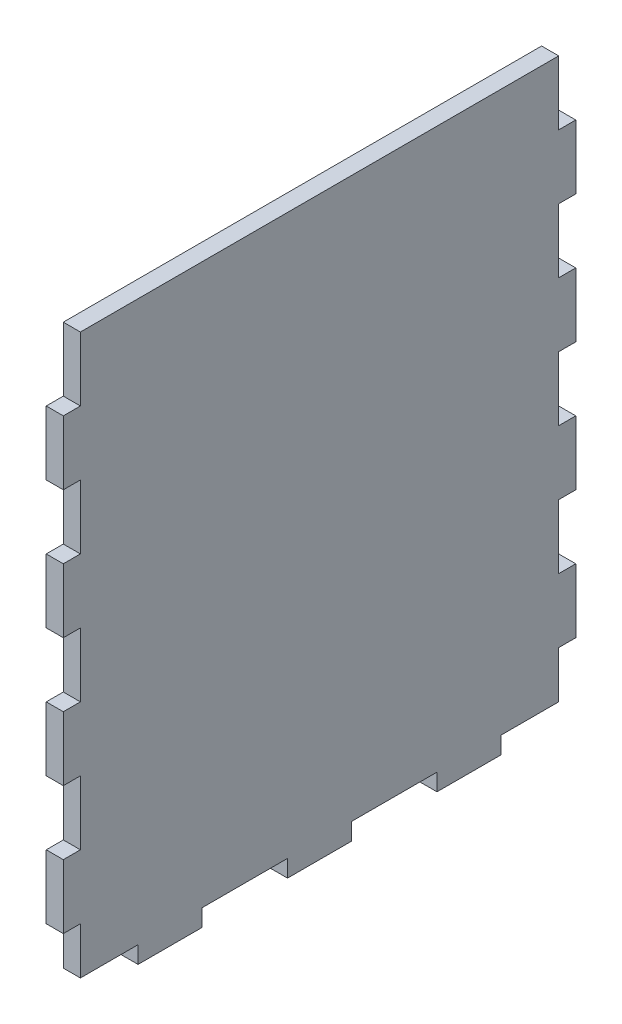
ISO-10303-21;
HEADER;
FILE_DESCRIPTION(('STEP AP214'),'2;1');
FILE_NAME('part.step','',(''),(''),'','','');
FILE_SCHEMA(('AUTOMOTIVE_DESIGN { 1 0 10303 214 1 1 1 1 }'));
ENDSEC;
DATA;
#1=APPLICATION_CONTEXT('core data for automotive mechanical design processes');
#2=APPLICATION_PROTOCOL_DEFINITION('international standard','automotive_design',2000,#1);
#3=PRODUCT_CONTEXT('',#1,'mechanical');
#4=PRODUCT('Part','Part','',(#3));
#5=PRODUCT_RELATED_PRODUCT_CATEGORY('part','',(#4));
#6=PRODUCT_DEFINITION_FORMATION('','',#4);
#7=PRODUCT_DEFINITION_CONTEXT('part definition',#1,'design');
#8=PRODUCT_DEFINITION('design','',#6,#7);
#9=PRODUCT_DEFINITION_SHAPE('','',#8);
#10=(LENGTH_UNIT() NAMED_UNIT(*) SI_UNIT(.MILLI.,.METRE.));
#11=(NAMED_UNIT(*) PLANE_ANGLE_UNIT() SI_UNIT($,.RADIAN.));
#12=(NAMED_UNIT(*) SI_UNIT($,.STERADIAN.) SOLID_ANGLE_UNIT());
#13=UNCERTAINTY_MEASURE_WITH_UNIT(LENGTH_MEASURE(1.E-05),#10,'distance_accuracy_value','');
#14=(GEOMETRIC_REPRESENTATION_CONTEXT(3) GLOBAL_UNCERTAINTY_ASSIGNED_CONTEXT((#13)) GLOBAL_UNIT_ASSIGNED_CONTEXT((#10,
#11,#12)) REPRESENTATION_CONTEXT('',''));
#15=CARTESIAN_POINT('',(0.,0.,0.));
#16=DIRECTION('',(0.,0.,1.));
#17=DIRECTION('',(1.,0.,0.));
#18=AXIS2_PLACEMENT_3D('',#15,#16,#17);
#19=CARTESIAN_POINT('',(4.,0.,-120.));
#20=DIRECTION('',(0.,0.,1.));
#21=DIRECTION('',(1.,0.,0.));
#22=AXIS2_PLACEMENT_3D('',#19,#20,#21);
#23=PLANE('',#22);
#24=DIRECTION('',(1.,0.,0.));
#25=VECTOR('',#24,1.);
#26=CARTESIAN_POINT('',(0.,15.,-120.));
#27=LINE('',#26,#25);
#28=CARTESIAN_POINT('',(0.,15.,-120.));
#29=VERTEX_POINT('',#28);
#30=CARTESIAN_POINT('',(4.,15.,-120.));
#31=VERTEX_POINT('',#30);
#32=EDGE_CURVE('E357',#29,#31,#27,.T.);
#33=ORIENTED_EDGE('',*,*,#32,.F.);
#34=DIRECTION('',(0.,1.,0.));
#35=VECTOR('',#34,1.);
#36=CARTESIAN_POINT('',(0.,0.,-120.));
#37=LINE('',#36,#35);
#38=CARTESIAN_POINT('',(0.,30.,-120.));
#39=VERTEX_POINT('',#38);
#40=EDGE_CURVE('E372',#29,#39,#37,.T.);
#41=ORIENTED_EDGE('',*,*,#40,.T.);
#42=DIRECTION('',(1.,0.,0.));
#43=VECTOR('',#42,1.);
#44=CARTESIAN_POINT('',(0.,30.,-120.));
#45=LINE('',#44,#43);
#46=CARTESIAN_POINT('',(4.,30.,-120.));
#47=VERTEX_POINT('',#46);
#48=EDGE_CURVE('E834',#39,#47,#45,.T.);
#49=ORIENTED_EDGE('',*,*,#48,.T.);
#50=DIRECTION('',(0.,1.,0.));
#51=VECTOR('',#50,1.);
#52=CARTESIAN_POINT('',(4.,0.,-120.));
#53=LINE('',#52,#51);
#54=EDGE_CURVE('E374',#31,#47,#53,.T.);
#55=ORIENTED_EDGE('',*,*,#54,.F.);
#56=EDGE_LOOP('',(#33,#41,#49,#55));
#57=FACE_BOUND('',#56,.T.);
#58=ADVANCED_FACE('F48',(#57),#23,.F.);
#59=DIRECTION('',(1.,0.,0.));
#60=VECTOR('',#59,1.);
#61=CARTESIAN_POINT('',(0.,120.,-120.));
#62=LINE('',#61,#60);
#63=CARTESIAN_POINT('',(0.,120.,-120.));
#64=VERTEX_POINT('',#63);
#65=CARTESIAN_POINT('',(4.,120.,-120.));
#66=VERTEX_POINT('',#65);
#67=EDGE_CURVE('E821',#64,#66,#62,.T.);
#68=ORIENTED_EDGE('',*,*,#67,.T.);
#69=CARTESIAN_POINT('',(4.,105.,-120.));
#70=VERTEX_POINT('',#69);
#71=EDGE_CURVE('E464',#70,#66,#53,.T.);
#72=ORIENTED_EDGE('',*,*,#71,.F.);
#73=DIRECTION('',(1.,0.,0.));
#74=VECTOR('',#73,1.);
#75=CARTESIAN_POINT('',(0.,105.,-120.));
#76=LINE('',#75,#74);
#77=CARTESIAN_POINT('',(0.,105.,-120.));
#78=VERTEX_POINT('',#77);
#79=EDGE_CURVE('E841',#78,#70,#76,.T.);
#80=ORIENTED_EDGE('',*,*,#79,.F.);
#81=EDGE_CURVE('E385',#78,#64,#37,.T.);
#82=ORIENTED_EDGE('',*,*,#81,.T.);
#83=EDGE_LOOP('',(#68,#72,#80,#82));
#84=FACE_BOUND('',#83,.T.);
#85=ADVANCED_FACE('F991',(#84),#23,.F.);
#86=DIRECTION('',(1.,0.,0.));
#87=VECTOR('',#86,1.);
#88=CARTESIAN_POINT('',(0.,60.,-120.));
#89=LINE('',#88,#87);
#90=CARTESIAN_POINT('',(0.,60.,-120.));
#91=VERTEX_POINT('',#90);
#92=CARTESIAN_POINT('',(4.,60.,-120.));
#93=VERTEX_POINT('',#92);
#94=EDGE_CURVE('E859',#91,#93,#89,.T.);
#95=ORIENTED_EDGE('',*,*,#94,.T.);
#96=CARTESIAN_POINT('',(4.,45.,-120.));
#97=VERTEX_POINT('',#96);
#98=EDGE_CURVE('E883',#97,#93,#53,.T.);
#99=ORIENTED_EDGE('',*,*,#98,.F.);
#100=DIRECTION('',(1.,0.,0.));
#101=VECTOR('',#100,1.);
#102=CARTESIAN_POINT('',(0.,45.,-120.));
#103=LINE('',#102,#101);
#104=CARTESIAN_POINT('',(0.,45.,-120.));
#105=VERTEX_POINT('',#104);
#106=EDGE_CURVE('E523',#105,#97,#103,.T.);
#107=ORIENTED_EDGE('',*,*,#106,.F.);
#108=EDGE_CURVE('E383',#105,#91,#37,.T.);
#109=ORIENTED_EDGE('',*,*,#108,.T.);
#110=EDGE_LOOP('',(#95,#99,#107,#109));
#111=FACE_BOUND('',#110,.T.);
#112=ADVANCED_FACE('F890',(#111),#23,.F.);
#113=DIRECTION('',(1.,0.,0.));
#114=VECTOR('',#113,1.);
#115=CARTESIAN_POINT('',(0.,75.,-120.));
#116=LINE('',#115,#114);
#117=CARTESIAN_POINT('',(0.,75.,-120.));
#118=VERTEX_POINT('',#117);
#119=CARTESIAN_POINT('',(4.,75.,-120.));
#120=VERTEX_POINT('',#119);
#121=EDGE_CURVE('E1006',#118,#120,#116,.T.);
#122=ORIENTED_EDGE('',*,*,#121,.F.);
#123=CARTESIAN_POINT('',(0.,90.,-120.));
#124=VERTEX_POINT('',#123);
#125=EDGE_CURVE('E392',#118,#124,#37,.T.);
#126=ORIENTED_EDGE('',*,*,#125,.T.);
#127=DIRECTION('',(1.,0.,0.));
#128=VECTOR('',#127,1.);
#129=CARTESIAN_POINT('',(0.,90.,-120.));
#130=LINE('',#129,#128);
#131=CARTESIAN_POINT('',(4.,90.,-120.));
#132=VERTEX_POINT('',#131);
#133=EDGE_CURVE('E366',#124,#132,#130,.T.);
#134=ORIENTED_EDGE('',*,*,#133,.T.);
#135=EDGE_CURVE('E892',#120,#132,#53,.T.);
#136=ORIENTED_EDGE('',*,*,#135,.F.);
#137=EDGE_LOOP('',(#122,#126,#134,#136));
#138=FACE_BOUND('',#137,.T.);
#139=ADVANCED_FACE('F992',(#138),#23,.F.);
#140=CARTESIAN_POINT('',(4.,0.,0.));
#141=DIRECTION('',(1.,0.,0.));
#142=DIRECTION('',(0.,0.,-1.));
#143=AXIS2_PLACEMENT_3D('',#140,#141,#142);
#144=PLANE('',#143);
#145=DIRECTION('',(0.,0.,-1.));
#146=VECTOR('',#145,1.);
#147=CARTESIAN_POINT('',(4.,4.,0.));
#148=LINE('',#147,#146);
#149=CARTESIAN_POINT('',(4.,4.,-102.5));
#150=VERTEX_POINT('',#149);
#151=CARTESIAN_POINT('',(4.,4.,-116.));
#152=VERTEX_POINT('',#151);
#153=EDGE_CURVE('E503',#150,#152,#148,.T.);
#154=ORIENTED_EDGE('',*,*,#153,.T.);
#155=DIRECTION('',(0.,1.,0.));
#156=VECTOR('',#155,1.);
#157=CARTESIAN_POINT('',(4.,0.,-116.));
#158=LINE('',#157,#156);
#159=CARTESIAN_POINT('',(4.,15.,-116.));
#160=VERTEX_POINT('',#159);
#161=EDGE_CURVE('E516',#152,#160,#158,.T.);
#162=ORIENTED_EDGE('',*,*,#161,.T.);
#163=DIRECTION('',(0.,0.,-1.));
#164=VECTOR('',#163,1.);
#165=CARTESIAN_POINT('',(4.,15.,0.));
#166=LINE('',#165,#164);
#167=EDGE_CURVE('E783',#160,#31,#166,.T.);
#168=ORIENTED_EDGE('',*,*,#167,.T.);
#169=ORIENTED_EDGE('',*,*,#54,.T.);
#170=DIRECTION('',(0.,0.,1.));
#171=VECTOR('',#170,1.);
#172=CARTESIAN_POINT('',(4.,30.,0.));
#173=LINE('',#172,#171);
#174=CARTESIAN_POINT('',(4.,30.,-116.));
#175=VERTEX_POINT('',#174);
#176=EDGE_CURVE('E1043',#47,#175,#173,.T.);
#177=ORIENTED_EDGE('',*,*,#176,.T.);
#178=DIRECTION('',(0.,1.,0.));
#179=VECTOR('',#178,1.);
#180=CARTESIAN_POINT('',(4.,0.,-116.));
#181=LINE('',#180,#179);
#182=CARTESIAN_POINT('',(4.,45.,-116.));
#183=VERTEX_POINT('',#182);
#184=EDGE_CURVE('E885',#175,#183,#181,.T.);
#185=ORIENTED_EDGE('',*,*,#184,.T.);
#186=DIRECTION('',(0.,0.,-1.));
#187=VECTOR('',#186,1.);
#188=CARTESIAN_POINT('',(4.,45.,0.));
#189=LINE('',#188,#187);
#190=EDGE_CURVE('E876',#183,#97,#189,.T.);
#191=ORIENTED_EDGE('',*,*,#190,.T.);
#192=ORIENTED_EDGE('',*,*,#98,.T.);
#193=DIRECTION('',(0.,0.,1.));
#194=VECTOR('',#193,1.);
#195=CARTESIAN_POINT('',(4.,60.,0.));
#196=LINE('',#195,#194);
#197=CARTESIAN_POINT('',(4.,60.,-116.));
#198=VERTEX_POINT('',#197);
#199=EDGE_CURVE('E1050',#93,#198,#196,.T.);
#200=ORIENTED_EDGE('',*,*,#199,.T.);
#201=DIRECTION('',(0.,1.,0.));
#202=VECTOR('',#201,1.);
#203=CARTESIAN_POINT('',(4.,0.,-116.));
#204=LINE('',#203,#202);
#205=CARTESIAN_POINT('',(4.,75.,-116.));
#206=VERTEX_POINT('',#205);
#207=EDGE_CURVE('E1042',#198,#206,#204,.T.);
#208=ORIENTED_EDGE('',*,*,#207,.T.);
#209=DIRECTION('',(0.,0.,-1.));
#210=VECTOR('',#209,1.);
#211=CARTESIAN_POINT('',(4.,75.,0.));
#212=LINE('',#211,#210);
#213=EDGE_CURVE('E1038',#206,#120,#212,.T.);
#214=ORIENTED_EDGE('',*,*,#213,.T.);
#215=ORIENTED_EDGE('',*,*,#135,.T.);
#216=DIRECTION('',(0.,0.,1.));
#217=VECTOR('',#216,1.);
#218=CARTESIAN_POINT('',(4.,90.,0.));
#219=LINE('',#218,#217);
#220=CARTESIAN_POINT('',(4.,90.,-116.));
#221=VERTEX_POINT('',#220);
#222=EDGE_CURVE('E887',#132,#221,#219,.T.);
#223=ORIENTED_EDGE('',*,*,#222,.T.);
#224=DIRECTION('',(0.,1.,0.));
#225=VECTOR('',#224,1.);
#226=CARTESIAN_POINT('',(4.,0.,-116.));
#227=LINE('',#226,#225);
#228=CARTESIAN_POINT('',(4.,105.,-116.));
#229=VERTEX_POINT('',#228);
#230=EDGE_CURVE('E1022',#221,#229,#227,.T.);
#231=ORIENTED_EDGE('',*,*,#230,.T.);
#232=DIRECTION('',(0.,0.,-1.));
#233=VECTOR('',#232,1.);
#234=CARTESIAN_POINT('',(4.,105.,-3.64291929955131E-13));
#235=LINE('',#234,#233);
#236=EDGE_CURVE('E529',#229,#70,#235,.T.);
#237=ORIENTED_EDGE('',*,*,#236,.T.);
#238=ORIENTED_EDGE('',*,*,#71,.T.);
#239=DIRECTION('',(0.,0.,1.));
#240=VECTOR('',#239,1.);
#241=CARTESIAN_POINT('',(4.,120.,0.));
#242=LINE('',#241,#240);
#243=CARTESIAN_POINT('',(4.,120.,-116.));
#244=VERTEX_POINT('',#243);
#245=EDGE_CURVE('E808',#66,#244,#242,.T.);
#246=ORIENTED_EDGE('',*,*,#245,.T.);
#247=DIRECTION('',(0.,1.,0.));
#248=VECTOR('',#247,1.);
#249=CARTESIAN_POINT('',(4.,0.,-116.));
#250=LINE('',#249,#248);
#251=CARTESIAN_POINT('',(4.,135.,-116.));
#252=VERTEX_POINT('',#251);
#253=EDGE_CURVE('E522',#244,#252,#250,.T.);
#254=ORIENTED_EDGE('',*,*,#253,.T.);
#255=DIRECTION('',(0.,0.,-1.));
#256=VECTOR('',#255,1.);
#257=CARTESIAN_POINT('',(4.,135.,0.));
#258=LINE('',#257,#256);
#259=CARTESIAN_POINT('',(4.,135.,-4.));
#260=VERTEX_POINT('',#259);
#261=EDGE_CURVE('E540',#260,#252,#258,.T.);
#262=ORIENTED_EDGE('',*,*,#261,.F.);
#263=DIRECTION('',(0.,1.,0.));
#264=VECTOR('',#263,1.);
#265=CARTESIAN_POINT('',(4.,0.,-4.));
#266=LINE('',#265,#264);
#267=CARTESIAN_POINT('',(4.,120.,-4.));
#268=VERTEX_POINT('',#267);
#269=EDGE_CURVE('E602',#268,#260,#266,.T.);
#270=ORIENTED_EDGE('',*,*,#269,.F.);
#271=DIRECTION('',(0.,0.,-1.));
#272=VECTOR('',#271,1.);
#273=CARTESIAN_POINT('',(4.,120.,0.));
#274=LINE('',#273,#272);
#275=CARTESIAN_POINT('',(4.,120.,0.));
#276=VERTEX_POINT('',#275);
#277=EDGE_CURVE('E586',#276,#268,#274,.T.);
#278=ORIENTED_EDGE('',*,*,#277,.F.);
#279=DIRECTION('',(0.,1.,0.));
#280=VECTOR('',#279,1.);
#281=CARTESIAN_POINT('',(4.,0.,0.));
#282=LINE('',#281,#280);
#283=CARTESIAN_POINT('',(4.,105.,0.));
#284=VERTEX_POINT('',#283);
#285=EDGE_CURVE('E544',#284,#276,#282,.T.);
#286=ORIENTED_EDGE('',*,*,#285,.F.);
#287=DIRECTION('',(0.,0.,1.));
#288=VECTOR('',#287,1.);
#289=CARTESIAN_POINT('',(4.,105.,3.6429192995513E-13));
#290=LINE('',#289,#288);
#291=CARTESIAN_POINT('',(4.,105.,-4.));
#292=VERTEX_POINT('',#291);
#293=EDGE_CURVE('E617',#292,#284,#290,.T.);
#294=ORIENTED_EDGE('',*,*,#293,.F.);
#295=DIRECTION('',(0.,1.,0.));
#296=VECTOR('',#295,1.);
#297=CARTESIAN_POINT('',(4.,0.,-4.));
#298=LINE('',#297,#296);
#299=CARTESIAN_POINT('',(4.,90.,-4.));
#300=VERTEX_POINT('',#299);
#301=EDGE_CURVE('E613',#300,#292,#298,.T.);
#302=ORIENTED_EDGE('',*,*,#301,.F.);
#303=DIRECTION('',(0.,0.,-1.));
#304=VECTOR('',#303,1.);
#305=CARTESIAN_POINT('',(4.,90.,0.));
#306=LINE('',#305,#304);
#307=CARTESIAN_POINT('',(4.,90.,0.));
#308=VERTEX_POINT('',#307);
#309=EDGE_CURVE('E609',#308,#300,#306,.T.);
#310=ORIENTED_EDGE('',*,*,#309,.F.);
#311=CARTESIAN_POINT('',(4.,75.,0.));
#312=VERTEX_POINT('',#311);
#313=EDGE_CURVE('E548',#312,#308,#282,.T.);
#314=ORIENTED_EDGE('',*,*,#313,.F.);
#315=DIRECTION('',(0.,0.,1.));
#316=VECTOR('',#315,1.);
#317=CARTESIAN_POINT('',(4.,75.,0.));
#318=LINE('',#317,#316);
#319=CARTESIAN_POINT('',(4.,75.,-4.));
#320=VERTEX_POINT('',#319);
#321=EDGE_CURVE('E582',#320,#312,#318,.T.);
#322=ORIENTED_EDGE('',*,*,#321,.F.);
#323=DIRECTION('',(0.,1.,0.));
#324=VECTOR('',#323,1.);
#325=CARTESIAN_POINT('',(4.,0.,-4.));
#326=LINE('',#325,#324);
#327=CARTESIAN_POINT('',(4.,60.,-4.));
#328=VERTEX_POINT('',#327);
#329=EDGE_CURVE('E578',#328,#320,#326,.T.);
#330=ORIENTED_EDGE('',*,*,#329,.F.);
#331=DIRECTION('',(0.,0.,-1.));
#332=VECTOR('',#331,1.);
#333=CARTESIAN_POINT('',(4.,60.,0.));
#334=LINE('',#333,#332);
#335=CARTESIAN_POINT('',(4.,60.,0.));
#336=VERTEX_POINT('',#335);
#337=EDGE_CURVE('E571',#336,#328,#334,.T.);
#338=ORIENTED_EDGE('',*,*,#337,.F.);
#339=CARTESIAN_POINT('',(4.,45.,0.));
#340=VERTEX_POINT('',#339);
#341=EDGE_CURVE('E650',#340,#336,#282,.T.);
#342=ORIENTED_EDGE('',*,*,#341,.F.);
#343=DIRECTION('',(0.,0.,1.));
#344=VECTOR('',#343,1.);
#345=CARTESIAN_POINT('',(4.,45.,0.));
#346=LINE('',#345,#344);
#347=CARTESIAN_POINT('',(4.,45.,-3.99999999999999));
#348=VERTEX_POINT('',#347);
#349=EDGE_CURVE('E568',#348,#340,#346,.T.);
#350=ORIENTED_EDGE('',*,*,#349,.F.);
#351=DIRECTION('',(0.,1.,0.));
#352=VECTOR('',#351,1.);
#353=CARTESIAN_POINT('',(4.,0.,-4.));
#354=LINE('',#353,#352);
#355=CARTESIAN_POINT('',(4.,30.,-3.99999999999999));
#356=VERTEX_POINT('',#355);
#357=EDGE_CURVE('E572',#356,#348,#354,.T.);
#358=ORIENTED_EDGE('',*,*,#357,.F.);
#359=DIRECTION('',(0.,0.,-1.));
#360=VECTOR('',#359,1.);
#361=CARTESIAN_POINT('',(4.,30.,0.));
#362=LINE('',#361,#360);
#363=CARTESIAN_POINT('',(4.,30.,0.));
#364=VERTEX_POINT('',#363);
#365=EDGE_CURVE('E620',#364,#356,#362,.T.);
#366=ORIENTED_EDGE('',*,*,#365,.F.);
#367=CARTESIAN_POINT('',(4.,15.,0.));
#368=VERTEX_POINT('',#367);
#369=EDGE_CURVE('E549',#368,#364,#282,.T.);
#370=ORIENTED_EDGE('',*,*,#369,.F.);
#371=DIRECTION('',(0.,0.,1.));
#372=VECTOR('',#371,1.);
#373=CARTESIAN_POINT('',(4.,15.,0.));
#374=LINE('',#373,#372);
#375=CARTESIAN_POINT('',(4.,15.,-4.));
#376=VERTEX_POINT('',#375);
#377=EDGE_CURVE('E508',#376,#368,#374,.T.);
#378=ORIENTED_EDGE('',*,*,#377,.F.);
#379=DIRECTION('',(0.,1.,0.));
#380=VECTOR('',#379,1.);
#381=CARTESIAN_POINT('',(4.,0.,-4.));
#382=LINE('',#381,#380);
#383=CARTESIAN_POINT('',(4.,4.,-4.));
#384=VERTEX_POINT('',#383);
#385=EDGE_CURVE('E598',#384,#376,#382,.T.);
#386=ORIENTED_EDGE('',*,*,#385,.F.);
#387=DIRECTION('',(0.,0.,-1.));
#388=VECTOR('',#387,1.);
#389=CARTESIAN_POINT('',(4.,4.,0.));
#390=LINE('',#389,#388);
#391=CARTESIAN_POINT('',(4.,4.,-17.5));
#392=VERTEX_POINT('',#391);
#393=EDGE_CURVE('E430',#384,#392,#390,.T.);
#394=ORIENTED_EDGE('',*,*,#393,.T.);
#395=DIRECTION('',(0.,1.,0.));
#396=VECTOR('',#395,1.);
#397=CARTESIAN_POINT('',(4.,0.,-17.5));
#398=LINE('',#397,#396);
#399=CARTESIAN_POINT('',(4.,0.,-17.5));
#400=VERTEX_POINT('',#399);
#401=EDGE_CURVE('E592',#400,#392,#398,.T.);
#402=ORIENTED_EDGE('',*,*,#401,.F.);
#403=DIRECTION('',(0.,0.,-1.));
#404=VECTOR('',#403,1.);
#405=CARTESIAN_POINT('',(4.,0.,0.));
#406=LINE('',#405,#404);
#407=CARTESIAN_POINT('',(4.,0.,-32.5));
#408=VERTEX_POINT('',#407);
#409=EDGE_CURVE('E461',#400,#408,#406,.T.);
#410=ORIENTED_EDGE('',*,*,#409,.T.);
#411=DIRECTION('',(0.,1.,0.));
#412=VECTOR('',#411,1.);
#413=CARTESIAN_POINT('',(4.,0.,-32.5));
#414=LINE('',#413,#412);
#415=CARTESIAN_POINT('',(4.,4.,-32.5));
#416=VERTEX_POINT('',#415);
#417=EDGE_CURVE('E966',#408,#416,#414,.T.);
#418=ORIENTED_EDGE('',*,*,#417,.T.);
#419=DIRECTION('',(0.,0.,-1.));
#420=VECTOR('',#419,1.);
#421=CARTESIAN_POINT('',(4.,4.,0.));
#422=LINE('',#421,#420);
#423=CARTESIAN_POINT('',(4.,4.,-52.5));
#424=VERTEX_POINT('',#423);
#425=EDGE_CURVE('E441',#416,#424,#422,.T.);
#426=ORIENTED_EDGE('',*,*,#425,.T.);
#427=DIRECTION('',(0.,1.,0.));
#428=VECTOR('',#427,1.);
#429=CARTESIAN_POINT('',(4.,0.,-52.5));
#430=LINE('',#429,#428);
#431=CARTESIAN_POINT('',(4.,0.,-52.5));
#432=VERTEX_POINT('',#431);
#433=EDGE_CURVE('E436',#432,#424,#430,.T.);
#434=ORIENTED_EDGE('',*,*,#433,.F.);
#435=CARTESIAN_POINT('',(4.,0.,-67.5));
#436=VERTEX_POINT('',#435);
#437=EDGE_CURVE('E459',#432,#436,#406,.T.);
#438=ORIENTED_EDGE('',*,*,#437,.T.);
#439=DIRECTION('',(0.,1.,0.));
#440=VECTOR('',#439,1.);
#441=CARTESIAN_POINT('',(4.,0.,-67.5));
#442=LINE('',#441,#440);
#443=CARTESIAN_POINT('',(4.,4.,-67.5));
#444=VERTEX_POINT('',#443);
#445=EDGE_CURVE('E486',#436,#444,#442,.T.);
#446=ORIENTED_EDGE('',*,*,#445,.T.);
#447=DIRECTION('',(0.,0.,-1.));
#448=VECTOR('',#447,1.);
#449=CARTESIAN_POINT('',(4.,4.,0.));
#450=LINE('',#449,#448);
#451=CARTESIAN_POINT('',(4.,4.,-87.5));
#452=VERTEX_POINT('',#451);
#453=EDGE_CURVE('E479',#444,#452,#450,.T.);
#454=ORIENTED_EDGE('',*,*,#453,.T.);
#455=DIRECTION('',(0.,1.,0.));
#456=VECTOR('',#455,1.);
#457=CARTESIAN_POINT('',(4.,0.,-87.5));
#458=LINE('',#457,#456);
#459=CARTESIAN_POINT('',(4.,0.,-87.5));
#460=VERTEX_POINT('',#459);
#461=EDGE_CURVE('E474',#460,#452,#458,.T.);
#462=ORIENTED_EDGE('',*,*,#461,.F.);
#463=CARTESIAN_POINT('',(4.,0.,-102.5));
#464=VERTEX_POINT('',#463);
#465=EDGE_CURVE('E453',#460,#464,#406,.T.);
#466=ORIENTED_EDGE('',*,*,#465,.T.);
#467=DIRECTION('',(0.,1.,0.));
#468=VECTOR('',#467,1.);
#469=CARTESIAN_POINT('',(4.,0.,-102.5));
#470=LINE('',#469,#468);
#471=EDGE_CURVE('E507',#464,#150,#470,.T.);
#472=ORIENTED_EDGE('',*,*,#471,.T.);
#473=EDGE_LOOP('',(#154,#162,#168,#169,#177,#185,#191,#192,#200,#208,#214,#215,#223,#231,#237,
#238,#246,#254,#262,#270,#278,#286,#294,#302,#310,#314,#322,#330,#338,#342,#350,#358,#366,#370,
#378,#386,#394,#402,#410,#418,#426,#434,#438,#446,#454,#462,#466,#472));
#474=FACE_BOUND('',#473,.T.);
#475=ADVANCED_FACE('F647',(#474),#144,.T.);
#476=CARTESIAN_POINT('',(0.,0.,0.));
#477=DIRECTION('',(1.,0.,0.));
#478=DIRECTION('',(0.,0.,-1.));
#479=AXIS2_PLACEMENT_3D('',#476,#477,#478);
#480=PLANE('',#479);
#481=DIRECTION('',(0.,1.,0.));
#482=VECTOR('',#481,1.);
#483=CARTESIAN_POINT('',(0.,0.,-116.));
#484=LINE('',#483,#482);
#485=CARTESIAN_POINT('',(0.,4.,-116.));
#486=VERTEX_POINT('',#485);
#487=CARTESIAN_POINT('',(0.,15.,-116.));
#488=VERTEX_POINT('',#487);
#489=EDGE_CURVE('E365',#486,#488,#484,.T.);
#490=ORIENTED_EDGE('',*,*,#489,.F.);
#491=DIRECTION('',(0.,0.,-1.));
#492=VECTOR('',#491,1.);
#493=CARTESIAN_POINT('',(0.,4.,0.));
#494=LINE('',#493,#492);
#495=CARTESIAN_POINT('',(0.,4.,-102.5));
#496=VERTEX_POINT('',#495);
#497=EDGE_CURVE('E1484',#496,#486,#494,.T.);
#498=ORIENTED_EDGE('',*,*,#497,.F.);
#499=DIRECTION('',(0.,1.,0.));
#500=VECTOR('',#499,1.);
#501=CARTESIAN_POINT('',(0.,0.,-102.5));
#502=LINE('',#501,#500);
#503=CARTESIAN_POINT('',(0.,0.,-102.5));
#504=VERTEX_POINT('',#503);
#505=EDGE_CURVE('E658',#504,#496,#502,.T.);
#506=ORIENTED_EDGE('',*,*,#505,.F.);
#507=DIRECTION('',(0.,0.,-1.));
#508=VECTOR('',#507,1.);
#509=CARTESIAN_POINT('',(0.,0.,0.));
#510=LINE('',#509,#508);
#511=CARTESIAN_POINT('',(0.,0.,-87.5));
#512=VERTEX_POINT('',#511);
#513=EDGE_CURVE('E406',#512,#504,#510,.T.);
#514=ORIENTED_EDGE('',*,*,#513,.F.);
#515=DIRECTION('',(0.,1.,0.));
#516=VECTOR('',#515,1.);
#517=CARTESIAN_POINT('',(0.,0.,-87.5));
#518=LINE('',#517,#516);
#519=CARTESIAN_POINT('',(0.,4.,-87.5));
#520=VERTEX_POINT('',#519);
#521=EDGE_CURVE('E933',#512,#520,#518,.T.);
#522=ORIENTED_EDGE('',*,*,#521,.T.);
#523=DIRECTION('',(0.,0.,-1.));
#524=VECTOR('',#523,1.);
#525=CARTESIAN_POINT('',(0.,4.,0.));
#526=LINE('',#525,#524);
#527=CARTESIAN_POINT('',(0.,4.,-67.5));
#528=VERTEX_POINT('',#527);
#529=EDGE_CURVE('E925',#528,#520,#526,.T.);
#530=ORIENTED_EDGE('',*,*,#529,.F.);
#531=DIRECTION('',(0.,1.,0.));
#532=VECTOR('',#531,1.);
#533=CARTESIAN_POINT('',(0.,0.,-67.5));
#534=LINE('',#533,#532);
#535=CARTESIAN_POINT('',(0.,0.,-67.5));
#536=VERTEX_POINT('',#535);
#537=EDGE_CURVE('E919',#536,#528,#534,.T.);
#538=ORIENTED_EDGE('',*,*,#537,.F.);
#539=CARTESIAN_POINT('',(0.,0.,-52.5));
#540=VERTEX_POINT('',#539);
#541=EDGE_CURVE('E405',#540,#536,#510,.T.);
#542=ORIENTED_EDGE('',*,*,#541,.F.);
#543=DIRECTION('',(0.,1.,0.));
#544=VECTOR('',#543,1.);
#545=CARTESIAN_POINT('',(0.,0.,-52.5));
#546=LINE('',#545,#544);
#547=CARTESIAN_POINT('',(0.,4.,-52.5));
#548=VERTEX_POINT('',#547);
#549=EDGE_CURVE('E927',#540,#548,#546,.T.);
#550=ORIENTED_EDGE('',*,*,#549,.T.);
#551=DIRECTION('',(0.,0.,-1.));
#552=VECTOR('',#551,1.);
#553=CARTESIAN_POINT('',(0.,4.,0.));
#554=LINE('',#553,#552);
#555=CARTESIAN_POINT('',(0.,4.,-32.5));
#556=VERTEX_POINT('',#555);
#557=EDGE_CURVE('E931',#556,#548,#554,.T.);
#558=ORIENTED_EDGE('',*,*,#557,.F.);
#559=DIRECTION('',(0.,1.,0.));
#560=VECTOR('',#559,1.);
#561=CARTESIAN_POINT('',(0.,0.,-32.5));
#562=LINE('',#561,#560);
#563=CARTESIAN_POINT('',(0.,0.,-32.5));
#564=VERTEX_POINT('',#563);
#565=EDGE_CURVE('E940',#564,#556,#562,.T.);
#566=ORIENTED_EDGE('',*,*,#565,.F.);
#567=CARTESIAN_POINT('',(0.,0.,-17.5));
#568=VERTEX_POINT('',#567);
#569=EDGE_CURVE('E396',#568,#564,#510,.T.);
#570=ORIENTED_EDGE('',*,*,#569,.F.);
#571=DIRECTION('',(0.,1.,0.));
#572=VECTOR('',#571,1.);
#573=CARTESIAN_POINT('',(0.,0.,-17.5));
#574=LINE('',#573,#572);
#575=CARTESIAN_POINT('',(0.,4.,-17.5));
#576=VERTEX_POINT('',#575);
#577=EDGE_CURVE('E943',#568,#576,#574,.T.);
#578=ORIENTED_EDGE('',*,*,#577,.T.);
#579=DIRECTION('',(0.,0.,-1.));
#580=VECTOR('',#579,1.);
#581=CARTESIAN_POINT('',(0.,4.,0.));
#582=LINE('',#581,#580);
#583=CARTESIAN_POINT('',(0.,4.,-4.));
#584=VERTEX_POINT('',#583);
#585=EDGE_CURVE('E947',#584,#576,#582,.T.);
#586=ORIENTED_EDGE('',*,*,#585,.F.);
#587=DIRECTION('',(0.,1.,0.));
#588=VECTOR('',#587,1.);
#589=CARTESIAN_POINT('',(0.,0.,-4.));
#590=LINE('',#589,#588);
#591=CARTESIAN_POINT('',(0.,15.,-4.));
#592=VERTEX_POINT('',#591);
#593=EDGE_CURVE('E706',#584,#592,#590,.T.);
#594=ORIENTED_EDGE('',*,*,#593,.T.);
#595=DIRECTION('',(0.,0.,1.));
#596=VECTOR('',#595,1.);
#597=CARTESIAN_POINT('',(0.,15.,0.));
#598=LINE('',#597,#596);
#599=CARTESIAN_POINT('',(0.,15.,0.));
#600=VERTEX_POINT('',#599);
#601=EDGE_CURVE('E736',#592,#600,#598,.T.);
#602=ORIENTED_EDGE('',*,*,#601,.T.);
#603=DIRECTION('',(0.,1.,0.));
#604=VECTOR('',#603,1.);
#605=CARTESIAN_POINT('',(0.,0.,0.));
#606=LINE('',#605,#604);
#607=CARTESIAN_POINT('',(0.,30.,0.));
#608=VERTEX_POINT('',#607);
#609=EDGE_CURVE('E460',#600,#608,#606,.T.);
#610=ORIENTED_EDGE('',*,*,#609,.T.);
#611=DIRECTION('',(0.,0.,-1.));
#612=VECTOR('',#611,1.);
#613=CARTESIAN_POINT('',(0.,30.,0.));
#614=LINE('',#613,#612);
#615=CARTESIAN_POINT('',(0.,30.,-3.99999999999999));
#616=VERTEX_POINT('',#615);
#617=EDGE_CURVE('E604',#608,#616,#614,.T.);
#618=ORIENTED_EDGE('',*,*,#617,.T.);
#619=DIRECTION('',(0.,1.,0.));
#620=VECTOR('',#619,1.);
#621=CARTESIAN_POINT('',(0.,30.,-3.99999999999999));
#622=LINE('',#621,#620);
#623=CARTESIAN_POINT('',(0.,45.,-3.99999999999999));
#624=VERTEX_POINT('',#623);
#625=EDGE_CURVE('E716',#616,#624,#622,.T.);
#626=ORIENTED_EDGE('',*,*,#625,.T.);
#627=DIRECTION('',(0.,0.,1.));
#628=VECTOR('',#627,1.);
#629=CARTESIAN_POINT('',(0.,45.,0.));
#630=LINE('',#629,#628);
#631=CARTESIAN_POINT('',(0.,45.,0.));
#632=VERTEX_POINT('',#631);
#633=EDGE_CURVE('E641',#624,#632,#630,.T.);
#634=ORIENTED_EDGE('',*,*,#633,.T.);
#635=CARTESIAN_POINT('',(0.,60.,0.));
#636=VERTEX_POINT('',#635);
#637=EDGE_CURVE('E1494',#632,#636,#606,.T.);
#638=ORIENTED_EDGE('',*,*,#637,.T.);
#639=DIRECTION('',(0.,0.,-1.));
#640=VECTOR('',#639,1.);
#641=CARTESIAN_POINT('',(0.,60.,0.));
#642=LINE('',#641,#640);
#643=CARTESIAN_POINT('',(0.,60.,-4.));
#644=VERTEX_POINT('',#643);
#645=EDGE_CURVE('E714',#636,#644,#642,.T.);
#646=ORIENTED_EDGE('',*,*,#645,.T.);
#647=DIRECTION('',(0.,1.,0.));
#648=VECTOR('',#647,1.);
#649=CARTESIAN_POINT('',(0.,60.,-4.));
#650=LINE('',#649,#648);
#651=CARTESIAN_POINT('',(0.,75.,-4.));
#652=VERTEX_POINT('',#651);
#653=EDGE_CURVE('E764',#644,#652,#650,.T.);
#654=ORIENTED_EDGE('',*,*,#653,.T.);
#655=DIRECTION('',(0.,0.,1.));
#656=VECTOR('',#655,1.);
#657=CARTESIAN_POINT('',(0.,75.,0.));
#658=LINE('',#657,#656);
#659=CARTESIAN_POINT('',(0.,75.,0.));
#660=VERTEX_POINT('',#659);
#661=EDGE_CURVE('E749',#652,#660,#658,.T.);
#662=ORIENTED_EDGE('',*,*,#661,.T.);
#663=CARTESIAN_POINT('',(0.,90.,0.));
#664=VERTEX_POINT('',#663);
#665=EDGE_CURVE('E1492',#660,#664,#606,.T.);
#666=ORIENTED_EDGE('',*,*,#665,.T.);
#667=DIRECTION('',(0.,0.,-1.));
#668=VECTOR('',#667,1.);
#669=CARTESIAN_POINT('',(0.,90.,0.));
#670=LINE('',#669,#668);
#671=CARTESIAN_POINT('',(0.,90.,-4.));
#672=VERTEX_POINT('',#671);
#673=EDGE_CURVE('E703',#664,#672,#670,.T.);
#674=ORIENTED_EDGE('',*,*,#673,.T.);
#675=DIRECTION('',(0.,1.,0.));
#676=VECTOR('',#675,1.);
#677=CARTESIAN_POINT('',(0.,90.,-4.));
#678=LINE('',#677,#676);
#679=CARTESIAN_POINT('',(0.,105.,-4.));
#680=VERTEX_POINT('',#679);
#681=EDGE_CURVE('E683',#672,#680,#678,.T.);
#682=ORIENTED_EDGE('',*,*,#681,.T.);
#683=DIRECTION('',(0.,0.,1.));
#684=VECTOR('',#683,1.);
#685=CARTESIAN_POINT('',(0.,105.,0.));
#686=LINE('',#685,#684);
#687=CARTESIAN_POINT('',(0.,105.,0.));
#688=VERTEX_POINT('',#687);
#689=EDGE_CURVE('E689',#680,#688,#686,.T.);
#690=ORIENTED_EDGE('',*,*,#689,.T.);
#691=CARTESIAN_POINT('',(0.,120.,0.));
#692=VERTEX_POINT('',#691);
#693=EDGE_CURVE('E389',#688,#692,#606,.T.);
#694=ORIENTED_EDGE('',*,*,#693,.T.);
#695=DIRECTION('',(0.,0.,-1.));
#696=VECTOR('',#695,1.);
#697=CARTESIAN_POINT('',(0.,120.,0.));
#698=LINE('',#697,#696);
#699=CARTESIAN_POINT('',(0.,120.,-4.));
#700=VERTEX_POINT('',#699);
#701=EDGE_CURVE('E760',#692,#700,#698,.T.);
#702=ORIENTED_EDGE('',*,*,#701,.T.);
#703=DIRECTION('',(0.,1.,0.));
#704=VECTOR('',#703,1.);
#705=CARTESIAN_POINT('',(0.,120.,-4.));
#706=LINE('',#705,#704);
#707=CARTESIAN_POINT('',(0.,135.,-4.));
#708=VERTEX_POINT('',#707);
#709=EDGE_CURVE('E774',#700,#708,#706,.T.);
#710=ORIENTED_EDGE('',*,*,#709,.T.);
#711=DIRECTION('',(0.,0.,-1.));
#712=VECTOR('',#711,1.);
#713=CARTESIAN_POINT('',(0.,135.,0.));
#714=LINE('',#713,#712);
#715=CARTESIAN_POINT('',(0.,135.,-116.));
#716=VERTEX_POINT('',#715);
#717=EDGE_CURVE('E382',#708,#716,#714,.T.);
#718=ORIENTED_EDGE('',*,*,#717,.T.);
#719=DIRECTION('',(0.,1.,0.));
#720=VECTOR('',#719,1.);
#721=CARTESIAN_POINT('',(0.,120.,-116.));
#722=LINE('',#721,#720);
#723=CARTESIAN_POINT('',(0.,120.,-116.));
#724=VERTEX_POINT('',#723);
#725=EDGE_CURVE('E1084',#724,#716,#722,.T.);
#726=ORIENTED_EDGE('',*,*,#725,.F.);
#727=DIRECTION('',(0.,0.,1.));
#728=VECTOR('',#727,1.);
#729=CARTESIAN_POINT('',(0.,120.,-120.));
#730=LINE('',#729,#728);
#731=EDGE_CURVE('E819',#64,#724,#730,.T.);
#732=ORIENTED_EDGE('',*,*,#731,.F.);
#733=ORIENTED_EDGE('',*,*,#81,.F.);
#734=DIRECTION('',(0.,0.,-1.));
#735=VECTOR('',#734,1.);
#736=CARTESIAN_POINT('',(0.,105.,-120.));
#737=LINE('',#736,#735);
#738=CARTESIAN_POINT('',(0.,105.,-116.));
#739=VERTEX_POINT('',#738);
#740=EDGE_CURVE('E830',#739,#78,#737,.T.);
#741=ORIENTED_EDGE('',*,*,#740,.F.);
#742=DIRECTION('',(0.,1.,0.));
#743=VECTOR('',#742,1.);
#744=CARTESIAN_POINT('',(0.,90.,-116.));
#745=LINE('',#744,#743);
#746=CARTESIAN_POINT('',(0.,90.,-116.));
#747=VERTEX_POINT('',#746);
#748=EDGE_CURVE('E833',#747,#739,#745,.T.);
#749=ORIENTED_EDGE('',*,*,#748,.F.);
#750=DIRECTION('',(0.,0.,1.));
#751=VECTOR('',#750,1.);
#752=CARTESIAN_POINT('',(0.,90.,-120.));
#753=LINE('',#752,#751);
#754=EDGE_CURVE('E838',#124,#747,#753,.T.);
#755=ORIENTED_EDGE('',*,*,#754,.F.);
#756=ORIENTED_EDGE('',*,*,#125,.F.);
#757=DIRECTION('',(0.,0.,-1.));
#758=VECTOR('',#757,1.);
#759=CARTESIAN_POINT('',(0.,75.,-120.));
#760=LINE('',#759,#758);
#761=CARTESIAN_POINT('',(0.,75.,-116.));
#762=VERTEX_POINT('',#761);
#763=EDGE_CURVE('E825',#762,#118,#760,.T.);
#764=ORIENTED_EDGE('',*,*,#763,.F.);
#765=DIRECTION('',(0.,1.,0.));
#766=VECTOR('',#765,1.);
#767=CARTESIAN_POINT('',(0.,60.,-116.));
#768=LINE('',#767,#766);
#769=CARTESIAN_POINT('',(0.,60.,-116.));
#770=VERTEX_POINT('',#769);
#771=EDGE_CURVE('E1067',#770,#762,#768,.T.);
#772=ORIENTED_EDGE('',*,*,#771,.F.);
#773=DIRECTION('',(0.,0.,1.));
#774=VECTOR('',#773,1.);
#775=CARTESIAN_POINT('',(0.,60.,-120.));
#776=LINE('',#775,#774);
#777=EDGE_CURVE('E1009',#91,#770,#776,.T.);
#778=ORIENTED_EDGE('',*,*,#777,.F.);
#779=ORIENTED_EDGE('',*,*,#108,.F.);
#780=DIRECTION('',(0.,0.,-1.));
#781=VECTOR('',#780,1.);
#782=CARTESIAN_POINT('',(0.,45.,-120.));
#783=LINE('',#782,#781);
#784=CARTESIAN_POINT('',(0.,45.,-116.));
#785=VERTEX_POINT('',#784);
#786=EDGE_CURVE('E855',#785,#105,#783,.T.);
#787=ORIENTED_EDGE('',*,*,#786,.F.);
#788=DIRECTION('',(0.,1.,0.));
#789=VECTOR('',#788,1.);
#790=CARTESIAN_POINT('',(0.,30.,-116.));
#791=LINE('',#790,#789);
#792=CARTESIAN_POINT('',(0.,30.,-116.));
#793=VERTEX_POINT('',#792);
#794=EDGE_CURVE('E858',#793,#785,#791,.T.);
#795=ORIENTED_EDGE('',*,*,#794,.F.);
#796=DIRECTION('',(0.,0.,1.));
#797=VECTOR('',#796,1.);
#798=CARTESIAN_POINT('',(0.,30.,-120.));
#799=LINE('',#798,#797);
#800=EDGE_CURVE('E380',#39,#793,#799,.T.);
#801=ORIENTED_EDGE('',*,*,#800,.F.);
#802=ORIENTED_EDGE('',*,*,#40,.F.);
#803=DIRECTION('',(0.,0.,-1.));
#804=VECTOR('',#803,1.);
#805=CARTESIAN_POINT('',(0.,15.,-120.));
#806=LINE('',#805,#804);
#807=EDGE_CURVE('E354',#488,#29,#806,.T.);
#808=ORIENTED_EDGE('',*,*,#807,.F.);
#809=EDGE_LOOP('',(#490,#498,#506,#514,#522,#530,#538,#542,#550,#558,#566,#570,#578,#586,#594,
#602,#610,#618,#626,#634,#638,#646,#654,#662,#666,#674,#682,#690,#694,#702,#710,#718,#726,#732,
#733,#741,#749,#755,#756,#764,#772,#778,#779,#787,#795,#801,#802,#808));
#810=FACE_BOUND('',#809,.T.);
#811=ADVANCED_FACE('F378',(#810),#480,.F.);
#812=CARTESIAN_POINT('',(4.,135.,0.));
#813=DIRECTION('',(0.,1.,0.));
#814=DIRECTION('',(0.,0.,1.));
#815=AXIS2_PLACEMENT_3D('',#812,#813,#814);
#816=PLANE('',#815);
#817=ORIENTED_EDGE('',*,*,#261,.T.);
#818=DIRECTION('',(1.,0.,0.));
#819=VECTOR('',#818,1.);
#820=CARTESIAN_POINT('',(0.,135.,-116.));
#821=LINE('',#820,#819);
#822=EDGE_CURVE('E815',#716,#252,#821,.T.);
#823=ORIENTED_EDGE('',*,*,#822,.F.);
#824=ORIENTED_EDGE('',*,*,#717,.F.);
#825=DIRECTION('',(1.,0.,0.));
#826=VECTOR('',#825,1.);
#827=CARTESIAN_POINT('',(0.,135.,-4.));
#828=LINE('',#827,#826);
#829=EDGE_CURVE('E779',#708,#260,#828,.T.);
#830=ORIENTED_EDGE('',*,*,#829,.T.);
#831=EDGE_LOOP('',(#817,#823,#824,#830));
#832=FACE_BOUND('',#831,.T.);
#833=ADVANCED_FACE('F804',(#832),#816,.T.);
#834=CARTESIAN_POINT('',(-1.2E-05,4.,0.));
#835=DIRECTION('',(0.,-1.,0.));
#836=DIRECTION('',(0.,0.,-1.));
#837=AXIS2_PLACEMENT_3D('',#834,#835,#836);
#838=PLANE('',#837);
#839=ORIENTED_EDGE('',*,*,#497,.T.);
#840=DIRECTION('',(1.,0.,0.));
#841=VECTOR('',#840,1.);
#842=CARTESIAN_POINT('',(-1.2E-05,4.,-116.));
#843=LINE('',#842,#841);
#844=EDGE_CURVE('E12',#486,#152,#843,.T.);
#845=ORIENTED_EDGE('',*,*,#844,.T.);
#846=ORIENTED_EDGE('',*,*,#153,.F.);
#847=DIRECTION('',(1.,0.,0.));
#848=VECTOR('',#847,1.);
#849=CARTESIAN_POINT('',(-1.2E-05,4.,-102.5));
#850=LINE('',#849,#848);
#851=EDGE_CURVE('E462',#496,#150,#850,.T.);
#852=ORIENTED_EDGE('',*,*,#851,.F.);
#853=EDGE_LOOP('',(#839,#845,#846,#852));
#854=FACE_BOUND('',#853,.T.);
#855=ADVANCED_FACE('F1157',(#854),#838,.T.);
#856=CARTESIAN_POINT('',(4.,0.,0.));
#857=DIRECTION('',(0.,0.,1.));
#858=DIRECTION('',(1.,0.,0.));
#859=AXIS2_PLACEMENT_3D('',#856,#857,#858);
#860=PLANE('',#859);
#861=DIRECTION('',(1.,0.,0.));
#862=VECTOR('',#861,1.);
#863=CARTESIAN_POINT('',(0.,75.,0.));
#864=LINE('',#863,#862);
#865=EDGE_CURVE('E668',#660,#312,#864,.T.);
#866=ORIENTED_EDGE('',*,*,#865,.T.);
#867=ORIENTED_EDGE('',*,*,#313,.T.);
#868=DIRECTION('',(1.,0.,0.));
#869=VECTOR('',#868,1.);
#870=CARTESIAN_POINT('',(0.,90.,0.));
#871=LINE('',#870,#869);
#872=EDGE_CURVE('E666',#664,#308,#871,.T.);
#873=ORIENTED_EDGE('',*,*,#872,.F.);
#874=ORIENTED_EDGE('',*,*,#665,.F.);
#875=EDGE_LOOP('',(#866,#867,#873,#874));
#876=FACE_BOUND('',#875,.T.);
#877=ADVANCED_FACE('F664',(#876),#860,.T.);
#878=DIRECTION('',(1.,0.,0.));
#879=VECTOR('',#878,1.);
#880=CARTESIAN_POINT('',(0.,60.,0.));
#881=LINE('',#880,#879);
#882=EDGE_CURVE('E746',#636,#336,#881,.T.);
#883=ORIENTED_EDGE('',*,*,#882,.F.);
#884=ORIENTED_EDGE('',*,*,#637,.F.);
#885=DIRECTION('',(1.,0.,0.));
#886=VECTOR('',#885,1.);
#887=CARTESIAN_POINT('',(0.,45.,0.));
#888=LINE('',#887,#886);
#889=EDGE_CURVE('E644',#632,#340,#888,.T.);
#890=ORIENTED_EDGE('',*,*,#889,.T.);
#891=ORIENTED_EDGE('',*,*,#341,.T.);
#892=EDGE_LOOP('',(#883,#884,#890,#891));
#893=FACE_BOUND('',#892,.T.);
#894=ADVANCED_FACE('F1388',(#893),#860,.T.);
#895=DIRECTION('',(1.,0.,0.));
#896=VECTOR('',#895,1.);
#897=CARTESIAN_POINT('',(0.,120.,0.));
#898=LINE('',#897,#896);
#899=EDGE_CURVE('E771',#692,#276,#898,.T.);
#900=ORIENTED_EDGE('',*,*,#899,.F.);
#901=ORIENTED_EDGE('',*,*,#693,.F.);
#902=DIRECTION('',(1.,0.,0.));
#903=VECTOR('',#902,1.);
#904=CARTESIAN_POINT('',(0.,105.,0.));
#905=LINE('',#904,#903);
#906=EDGE_CURVE('E691',#688,#284,#905,.T.);
#907=ORIENTED_EDGE('',*,*,#906,.T.);
#908=ORIENTED_EDGE('',*,*,#285,.T.);
#909=EDGE_LOOP('',(#900,#901,#907,#908));
#910=FACE_BOUND('',#909,.T.);
#911=ADVANCED_FACE('F797',(#910),#860,.T.);
#912=CARTESIAN_POINT('',(4.,0.,0.));
#913=DIRECTION('',(0.,1.,0.));
#914=DIRECTION('',(0.,0.,1.));
#915=AXIS2_PLACEMENT_3D('',#912,#913,#914);
#916=PLANE('',#915);
#917=ORIENTED_EDGE('',*,*,#409,.F.);
#918=DIRECTION('',(1.,0.,0.));
#919=VECTOR('',#918,1.);
#920=CARTESIAN_POINT('',(-1.2E-05,0.,-17.5));
#921=LINE('',#920,#919);
#922=EDGE_CURVE('E423',#568,#400,#921,.T.);
#923=ORIENTED_EDGE('',*,*,#922,.F.);
#924=ORIENTED_EDGE('',*,*,#569,.T.);
#925=DIRECTION('',(1.,0.,0.));
#926=VECTOR('',#925,1.);
#927=CARTESIAN_POINT('',(-1.2E-05,0.,-32.5));
#928=LINE('',#927,#926);
#929=EDGE_CURVE('E957',#564,#408,#928,.T.);
#930=ORIENTED_EDGE('',*,*,#929,.T.);
#931=EDGE_LOOP('',(#917,#923,#924,#930));
#932=FACE_BOUND('',#931,.T.);
#933=ADVANCED_FACE('F50',(#932),#916,.F.);
#934=ORIENTED_EDGE('',*,*,#437,.F.);
#935=DIRECTION('',(1.,0.,0.));
#936=VECTOR('',#935,1.);
#937=CARTESIAN_POINT('',(-1.2E-05,0.,-52.5));
#938=LINE('',#937,#936);
#939=EDGE_CURVE('E481',#540,#432,#938,.T.);
#940=ORIENTED_EDGE('',*,*,#939,.F.);
#941=ORIENTED_EDGE('',*,*,#541,.T.);
#942=DIRECTION('',(1.,0.,0.));
#943=VECTOR('',#942,1.);
#944=CARTESIAN_POINT('',(-1.2E-05,0.,-67.5));
#945=LINE('',#944,#943);
#946=EDGE_CURVE('E442',#536,#436,#945,.T.);
#947=ORIENTED_EDGE('',*,*,#946,.T.);
#948=EDGE_LOOP('',(#934,#940,#941,#947));
#949=FACE_BOUND('',#948,.T.);
#950=ADVANCED_FACE('F914',(#949),#916,.F.);
#951=ORIENTED_EDGE('',*,*,#465,.F.);
#952=DIRECTION('',(1.,0.,0.));
#953=VECTOR('',#952,1.);
#954=CARTESIAN_POINT('',(-1.2E-05,0.,-87.5));
#955=LINE('',#954,#953);
#956=EDGE_CURVE('E491',#512,#460,#955,.T.);
#957=ORIENTED_EDGE('',*,*,#956,.F.);
#958=ORIENTED_EDGE('',*,*,#513,.T.);
#959=DIRECTION('',(1.,0.,0.));
#960=VECTOR('',#959,1.);
#961=CARTESIAN_POINT('',(-1.2E-05,0.,-102.5));
#962=LINE('',#961,#960);
#963=EDGE_CURVE('E480',#504,#464,#962,.T.);
#964=ORIENTED_EDGE('',*,*,#963,.T.);
#965=EDGE_LOOP('',(#951,#957,#958,#964));
#966=FACE_BOUND('',#965,.T.);
#967=ADVANCED_FACE('F1164',(#966),#916,.F.);
#968=DIRECTION('',(1.,0.,0.));
#969=VECTOR('',#968,1.);
#970=CARTESIAN_POINT('',(0.,15.,0.));
#971=LINE('',#970,#969);
#972=EDGE_CURVE('E603',#600,#368,#971,.T.);
#973=ORIENTED_EDGE('',*,*,#972,.T.);
#974=ORIENTED_EDGE('',*,*,#369,.T.);
#975=DIRECTION('',(1.,0.,0.));
#976=VECTOR('',#975,1.);
#977=CARTESIAN_POINT('',(0.,30.,0.));
#978=LINE('',#977,#976);
#979=EDGE_CURVE('E707',#608,#364,#978,.T.);
#980=ORIENTED_EDGE('',*,*,#979,.F.);
#981=ORIENTED_EDGE('',*,*,#609,.F.);
#982=EDGE_LOOP('',(#973,#974,#980,#981));
#983=FACE_BOUND('',#982,.T.);
#984=ADVANCED_FACE('F727',(#983),#860,.T.);
#985=CARTESIAN_POINT('',(-1.2E-05,0.,-102.5));
#986=DIRECTION('',(0.,0.,-1.));
#987=DIRECTION('',(-1.,0.,0.));
#988=AXIS2_PLACEMENT_3D('',#985,#986,#987);
#989=PLANE('',#988);
#990=ORIENTED_EDGE('',*,*,#505,.T.);
#991=ORIENTED_EDGE('',*,*,#851,.T.);
#992=ORIENTED_EDGE('',*,*,#471,.F.);
#993=ORIENTED_EDGE('',*,*,#963,.F.);
#994=EDGE_LOOP('',(#990,#991,#992,#993));
#995=FACE_BOUND('',#994,.T.);
#996=ADVANCED_FACE('F1153',(#995),#989,.T.);
#997=CARTESIAN_POINT('',(-1.2E-05,0.,-67.5));
#998=DIRECTION('',(0.,0.,-1.));
#999=DIRECTION('',(-1.,0.,0.));
#1000=AXIS2_PLACEMENT_3D('',#997,#998,#999);
#1001=PLANE('',#1000);
#1002=ORIENTED_EDGE('',*,*,#537,.T.);
#1003=DIRECTION('',(1.,0.,0.));
#1004=VECTOR('',#1003,1.);
#1005=CARTESIAN_POINT('',(-1.2E-05,4.,-67.5));
#1006=LINE('',#1005,#1004);
#1007=EDGE_CURVE('E495',#528,#444,#1006,.T.);
#1008=ORIENTED_EDGE('',*,*,#1007,.T.);
#1009=ORIENTED_EDGE('',*,*,#445,.F.);
#1010=ORIENTED_EDGE('',*,*,#946,.F.);
#1011=EDGE_LOOP('',(#1002,#1008,#1009,#1010));
#1012=FACE_BOUND('',#1011,.T.);
#1013=ADVANCED_FACE('F918',(#1012),#1001,.T.);
#1014=CARTESIAN_POINT('',(-1.2E-05,4.,0.));
#1015=DIRECTION('',(0.,-1.,0.));
#1016=DIRECTION('',(0.,0.,-1.));
#1017=AXIS2_PLACEMENT_3D('',#1014,#1015,#1016);
#1018=PLANE('',#1017);
#1019=ORIENTED_EDGE('',*,*,#529,.T.);
#1020=DIRECTION('',(1.,0.,0.));
#1021=VECTOR('',#1020,1.);
#1022=CARTESIAN_POINT('',(-1.2E-05,4.,-87.5));
#1023=LINE('',#1022,#1021);
#1024=EDGE_CURVE('E498',#520,#452,#1023,.T.);
#1025=ORIENTED_EDGE('',*,*,#1024,.T.);
#1026=ORIENTED_EDGE('',*,*,#453,.F.);
#1027=ORIENTED_EDGE('',*,*,#1007,.F.);
#1028=EDGE_LOOP('',(#1019,#1025,#1026,#1027));
#1029=FACE_BOUND('',#1028,.T.);
#1030=ADVANCED_FACE('F1144',(#1029),#1018,.T.);
#1031=CARTESIAN_POINT('',(-1.2E-05,0.,-87.5));
#1032=DIRECTION('',(0.,0.,-1.));
#1033=DIRECTION('',(-1.,0.,0.));
#1034=AXIS2_PLACEMENT_3D('',#1031,#1032,#1033);
#1035=PLANE('',#1034);
#1036=ORIENTED_EDGE('',*,*,#956,.T.);
#1037=ORIENTED_EDGE('',*,*,#461,.T.);
#1038=ORIENTED_EDGE('',*,*,#1024,.F.);
#1039=ORIENTED_EDGE('',*,*,#521,.F.);
#1040=EDGE_LOOP('',(#1036,#1037,#1038,#1039));
#1041=FACE_BOUND('',#1040,.T.);
#1042=ADVANCED_FACE('F1140',(#1041),#1035,.F.);
#1043=CARTESIAN_POINT('',(-1.2E-05,0.,-32.5));
#1044=DIRECTION('',(0.,0.,-1.));
#1045=DIRECTION('',(-1.,0.,0.));
#1046=AXIS2_PLACEMENT_3D('',#1043,#1044,#1045);
#1047=PLANE('',#1046);
#1048=ORIENTED_EDGE('',*,*,#565,.T.);
#1049=DIRECTION('',(1.,0.,0.));
#1050=VECTOR('',#1049,1.);
#1051=CARTESIAN_POINT('',(-1.2E-05,4.,-32.5));
#1052=LINE('',#1051,#1050);
#1053=EDGE_CURVE('E960',#556,#416,#1052,.T.);
#1054=ORIENTED_EDGE('',*,*,#1053,.T.);
#1055=ORIENTED_EDGE('',*,*,#417,.F.);
#1056=ORIENTED_EDGE('',*,*,#929,.F.);
#1057=EDGE_LOOP('',(#1048,#1054,#1055,#1056));
#1058=FACE_BOUND('',#1057,.T.);
#1059=ADVANCED_FACE('F987',(#1058),#1047,.T.);
#1060=CARTESIAN_POINT('',(-1.2E-05,4.,0.));
#1061=DIRECTION('',(0.,-1.,0.));
#1062=DIRECTION('',(0.,0.,-1.));
#1063=AXIS2_PLACEMENT_3D('',#1060,#1061,#1062);
#1064=PLANE('',#1063);
#1065=ORIENTED_EDGE('',*,*,#557,.T.);
#1066=DIRECTION('',(1.,0.,0.));
#1067=VECTOR('',#1066,1.);
#1068=CARTESIAN_POINT('',(-1.2E-05,4.,-52.5));
#1069=LINE('',#1068,#1067);
#1070=EDGE_CURVE('E964',#548,#424,#1069,.T.);
#1071=ORIENTED_EDGE('',*,*,#1070,.T.);
#1072=ORIENTED_EDGE('',*,*,#425,.F.);
#1073=ORIENTED_EDGE('',*,*,#1053,.F.);
#1074=EDGE_LOOP('',(#1065,#1071,#1072,#1073));
#1075=FACE_BOUND('',#1074,.T.);
#1076=ADVANCED_FACE('F976',(#1075),#1064,.T.);
#1077=CARTESIAN_POINT('',(-1.2E-05,0.,-52.5));
#1078=DIRECTION('',(0.,0.,-1.));
#1079=DIRECTION('',(-1.,0.,0.));
#1080=AXIS2_PLACEMENT_3D('',#1077,#1078,#1079);
#1081=PLANE('',#1080);
#1082=ORIENTED_EDGE('',*,*,#939,.T.);
#1083=ORIENTED_EDGE('',*,*,#433,.T.);
#1084=ORIENTED_EDGE('',*,*,#1070,.F.);
#1085=ORIENTED_EDGE('',*,*,#549,.F.);
#1086=EDGE_LOOP('',(#1082,#1083,#1084,#1085));
#1087=FACE_BOUND('',#1086,.T.);
#1088=ADVANCED_FACE('F978',(#1087),#1081,.F.);
#1089=CARTESIAN_POINT('',(-1.2E-05,4.,0.));
#1090=DIRECTION('',(0.,-1.,0.));
#1091=DIRECTION('',(0.,0.,-1.));
#1092=AXIS2_PLACEMENT_3D('',#1089,#1090,#1091);
#1093=PLANE('',#1092);
#1094=DIRECTION('',(1.,0.,0.));
#1095=VECTOR('',#1094,1.);
#1096=CARTESIAN_POINT('',(-1.2E-05,4.,-4.));
#1097=LINE('',#1096,#1095);
#1098=EDGE_CURVE('E57',#584,#384,#1097,.T.);
#1099=ORIENTED_EDGE('',*,*,#1098,.F.);
#1100=ORIENTED_EDGE('',*,*,#585,.T.);
#1101=DIRECTION('',(1.,0.,0.));
#1102=VECTOR('',#1101,1.);
#1103=CARTESIAN_POINT('',(-1.2E-05,4.,-17.5));
#1104=LINE('',#1103,#1102);
#1105=EDGE_CURVE('E416',#576,#392,#1104,.T.);
#1106=ORIENTED_EDGE('',*,*,#1105,.T.);
#1107=ORIENTED_EDGE('',*,*,#393,.F.);
#1108=EDGE_LOOP('',(#1099,#1100,#1106,#1107));
#1109=FACE_BOUND('',#1108,.T.);
#1110=ADVANCED_FACE('F953',(#1109),#1093,.T.);
#1111=CARTESIAN_POINT('',(-1.2E-05,0.,-17.5));
#1112=DIRECTION('',(0.,0.,-1.));
#1113=DIRECTION('',(-1.,0.,0.));
#1114=AXIS2_PLACEMENT_3D('',#1111,#1112,#1113);
#1115=PLANE('',#1114);
#1116=ORIENTED_EDGE('',*,*,#922,.T.);
#1117=ORIENTED_EDGE('',*,*,#401,.T.);
#1118=ORIENTED_EDGE('',*,*,#1105,.F.);
#1119=ORIENTED_EDGE('',*,*,#577,.F.);
#1120=EDGE_LOOP('',(#1116,#1117,#1118,#1119));
#1121=FACE_BOUND('',#1120,.T.);
#1122=ADVANCED_FACE('F956',(#1121),#1115,.F.);
#1123=CARTESIAN_POINT('',(0.,15.,0.));
#1124=DIRECTION('',(0.,1.,0.));
#1125=DIRECTION('',(0.,0.,1.));
#1126=AXIS2_PLACEMENT_3D('',#1123,#1124,#1125);
#1127=PLANE('',#1126);
#1128=ORIENTED_EDGE('',*,*,#377,.T.);
#1129=ORIENTED_EDGE('',*,*,#972,.F.);
#1130=ORIENTED_EDGE('',*,*,#601,.F.);
#1131=DIRECTION('',(1.,0.,0.));
#1132=VECTOR('',#1131,1.);
#1133=CARTESIAN_POINT('',(0.,15.,-4.));
#1134=LINE('',#1133,#1132);
#1135=EDGE_CURVE('E735',#592,#376,#1134,.T.);
#1136=ORIENTED_EDGE('',*,*,#1135,.T.);
#1137=EDGE_LOOP('',(#1128,#1129,#1130,#1136));
#1138=FACE_BOUND('',#1137,.T.);
#1139=ADVANCED_FACE('F733',(#1138),#1127,.F.);
#1140=CARTESIAN_POINT('',(0.,0.,-4.));
#1141=DIRECTION('',(0.,0.,-1.));
#1142=DIRECTION('',(0.,1.,0.));
#1143=AXIS2_PLACEMENT_3D('',#1140,#1141,#1142);
#1144=PLANE('',#1143);
#1145=ORIENTED_EDGE('',*,*,#385,.T.);
#1146=ORIENTED_EDGE('',*,*,#1135,.F.);
#1147=ORIENTED_EDGE('',*,*,#593,.F.);
#1148=ORIENTED_EDGE('',*,*,#1098,.T.);
#1149=EDGE_LOOP('',(#1145,#1146,#1147,#1148));
#1150=FACE_BOUND('',#1149,.T.);
#1151=ADVANCED_FACE('F951',(#1150),#1144,.F.);
#1152=CARTESIAN_POINT('',(0.,120.,-4.));
#1153=DIRECTION('',(0.,0.,-1.));
#1154=DIRECTION('',(-1.,0.,0.));
#1155=AXIS2_PLACEMENT_3D('',#1152,#1153,#1154);
#1156=PLANE('',#1155);
#1157=ORIENTED_EDGE('',*,*,#269,.T.);
#1158=ORIENTED_EDGE('',*,*,#829,.F.);
#1159=ORIENTED_EDGE('',*,*,#709,.F.);
#1160=DIRECTION('',(1.,0.,0.));
#1161=VECTOR('',#1160,1.);
#1162=CARTESIAN_POINT('',(0.,120.,-4.));
#1163=LINE('',#1162,#1161);
#1164=EDGE_CURVE('E775',#700,#268,#1163,.T.);
#1165=ORIENTED_EDGE('',*,*,#1164,.T.);
#1166=EDGE_LOOP('',(#1157,#1158,#1159,#1165));
#1167=FACE_BOUND('',#1166,.T.);
#1168=ADVANCED_FACE('F802',(#1167),#1156,.F.);
#1169=CARTESIAN_POINT('',(0.,120.,0.));
#1170=DIRECTION('',(0.,-1.,0.));
#1171=DIRECTION('',(0.,0.,-1.));
#1172=AXIS2_PLACEMENT_3D('',#1169,#1170,#1171);
#1173=PLANE('',#1172);
#1174=ORIENTED_EDGE('',*,*,#277,.T.);
#1175=ORIENTED_EDGE('',*,*,#1164,.F.);
#1176=ORIENTED_EDGE('',*,*,#701,.F.);
#1177=ORIENTED_EDGE('',*,*,#899,.T.);
#1178=EDGE_LOOP('',(#1174,#1175,#1176,#1177));
#1179=FACE_BOUND('',#1178,.T.);
#1180=ADVANCED_FACE('F794',(#1179),#1173,.F.);
#1181=CARTESIAN_POINT('',(0.,105.,0.));
#1182=DIRECTION('',(0.,1.,0.));
#1183=DIRECTION('',(0.,0.,1.));
#1184=AXIS2_PLACEMENT_3D('',#1181,#1182,#1183);
#1185=PLANE('',#1184);
#1186=ORIENTED_EDGE('',*,*,#293,.T.);
#1187=ORIENTED_EDGE('',*,*,#906,.F.);
#1188=ORIENTED_EDGE('',*,*,#689,.F.);
#1189=DIRECTION('',(1.,0.,0.));
#1190=VECTOR('',#1189,1.);
#1191=CARTESIAN_POINT('',(0.,105.,-4.));
#1192=LINE('',#1191,#1190);
#1193=EDGE_CURVE('E685',#680,#292,#1192,.T.);
#1194=ORIENTED_EDGE('',*,*,#1193,.T.);
#1195=EDGE_LOOP('',(#1186,#1187,#1188,#1194));
#1196=FACE_BOUND('',#1195,.T.);
#1197=ADVANCED_FACE('F1122',(#1196),#1185,.F.);
#1198=CARTESIAN_POINT('',(0.,90.,-4.));
#1199=DIRECTION('',(0.,0.,-1.));
#1200=DIRECTION('',(-1.,0.,0.));
#1201=AXIS2_PLACEMENT_3D('',#1198,#1199,#1200);
#1202=PLANE('',#1201);
#1203=ORIENTED_EDGE('',*,*,#301,.T.);
#1204=ORIENTED_EDGE('',*,*,#1193,.F.);
#1205=ORIENTED_EDGE('',*,*,#681,.F.);
#1206=DIRECTION('',(1.,0.,0.));
#1207=VECTOR('',#1206,1.);
#1208=CARTESIAN_POINT('',(0.,90.,-4.));
#1209=LINE('',#1208,#1207);
#1210=EDGE_CURVE('E677',#672,#300,#1209,.T.);
#1211=ORIENTED_EDGE('',*,*,#1210,.T.);
#1212=EDGE_LOOP('',(#1203,#1204,#1205,#1211));
#1213=FACE_BOUND('',#1212,.T.);
#1214=ADVANCED_FACE('F680',(#1213),#1202,.F.);
#1215=CARTESIAN_POINT('',(0.,90.,0.));
#1216=DIRECTION('',(0.,-1.,0.));
#1217=DIRECTION('',(0.,0.,-1.));
#1218=AXIS2_PLACEMENT_3D('',#1215,#1216,#1217);
#1219=PLANE('',#1218);
#1220=ORIENTED_EDGE('',*,*,#309,.T.);
#1221=ORIENTED_EDGE('',*,*,#1210,.F.);
#1222=ORIENTED_EDGE('',*,*,#673,.F.);
#1223=ORIENTED_EDGE('',*,*,#872,.T.);
#1224=EDGE_LOOP('',(#1220,#1221,#1222,#1223));
#1225=FACE_BOUND('',#1224,.T.);
#1226=ADVANCED_FACE('F676',(#1225),#1219,.F.);
#1227=CARTESIAN_POINT('',(0.,45.,0.));
#1228=DIRECTION('',(0.,1.,0.));
#1229=DIRECTION('',(0.,0.,1.));
#1230=AXIS2_PLACEMENT_3D('',#1227,#1228,#1229);
#1231=PLANE('',#1230);
#1232=ORIENTED_EDGE('',*,*,#349,.T.);
#1233=ORIENTED_EDGE('',*,*,#889,.F.);
#1234=ORIENTED_EDGE('',*,*,#633,.F.);
#1235=DIRECTION('',(1.,0.,0.));
#1236=VECTOR('',#1235,1.);
#1237=CARTESIAN_POINT('',(0.,45.,-3.99999999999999));
#1238=LINE('',#1237,#1236);
#1239=EDGE_CURVE('E632',#624,#348,#1238,.T.);
#1240=ORIENTED_EDGE('',*,*,#1239,.T.);
#1241=EDGE_LOOP('',(#1232,#1233,#1234,#1240));
#1242=FACE_BOUND('',#1241,.T.);
#1243=ADVANCED_FACE('F638',(#1242),#1231,.F.);
#1244=CARTESIAN_POINT('',(0.,30.,-3.99999999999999));
#1245=DIRECTION('',(0.,0.,-1.));
#1246=DIRECTION('',(0.,1.,0.));
#1247=AXIS2_PLACEMENT_3D('',#1244,#1245,#1246);
#1248=PLANE('',#1247);
#1249=ORIENTED_EDGE('',*,*,#357,.T.);
#1250=ORIENTED_EDGE('',*,*,#1239,.F.);
#1251=ORIENTED_EDGE('',*,*,#625,.F.);
#1252=DIRECTION('',(1.,0.,0.));
#1253=VECTOR('',#1252,1.);
#1254=CARTESIAN_POINT('',(0.,30.,-3.99999999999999));
#1255=LINE('',#1254,#1253);
#1256=EDGE_CURVE('E634',#616,#356,#1255,.T.);
#1257=ORIENTED_EDGE('',*,*,#1256,.T.);
#1258=EDGE_LOOP('',(#1249,#1250,#1251,#1257));
#1259=FACE_BOUND('',#1258,.T.);
#1260=ADVANCED_FACE('F631',(#1259),#1248,.F.);
#1261=CARTESIAN_POINT('',(0.,30.,0.));
#1262=DIRECTION('',(0.,-1.,0.));
#1263=DIRECTION('',(0.,0.,-1.));
#1264=AXIS2_PLACEMENT_3D('',#1261,#1262,#1263);
#1265=PLANE('',#1264);
#1266=ORIENTED_EDGE('',*,*,#365,.T.);
#1267=ORIENTED_EDGE('',*,*,#1256,.F.);
#1268=ORIENTED_EDGE('',*,*,#617,.F.);
#1269=ORIENTED_EDGE('',*,*,#979,.T.);
#1270=EDGE_LOOP('',(#1266,#1267,#1268,#1269));
#1271=FACE_BOUND('',#1270,.T.);
#1272=ADVANCED_FACE('F724',(#1271),#1265,.F.);
#1273=CARTESIAN_POINT('',(0.,75.,0.));
#1274=DIRECTION('',(0.,1.,0.));
#1275=DIRECTION('',(0.,0.,1.));
#1276=AXIS2_PLACEMENT_3D('',#1273,#1274,#1275);
#1277=PLANE('',#1276);
#1278=ORIENTED_EDGE('',*,*,#321,.T.);
#1279=ORIENTED_EDGE('',*,*,#865,.F.);
#1280=ORIENTED_EDGE('',*,*,#661,.F.);
#1281=DIRECTION('',(1.,0.,0.));
#1282=VECTOR('',#1281,1.);
#1283=CARTESIAN_POINT('',(0.,75.,-4.));
#1284=LINE('',#1283,#1282);
#1285=EDGE_CURVE('E754',#652,#320,#1284,.T.);
#1286=ORIENTED_EDGE('',*,*,#1285,.T.);
#1287=EDGE_LOOP('',(#1278,#1279,#1280,#1286));
#1288=FACE_BOUND('',#1287,.T.);
#1289=ADVANCED_FACE('F1115',(#1288),#1277,.F.);
#1290=CARTESIAN_POINT('',(0.,60.,-4.));
#1291=DIRECTION('',(0.,0.,-1.));
#1292=DIRECTION('',(-1.,0.,0.));
#1293=AXIS2_PLACEMENT_3D('',#1290,#1291,#1292);
#1294=PLANE('',#1293);
#1295=ORIENTED_EDGE('',*,*,#329,.T.);
#1296=ORIENTED_EDGE('',*,*,#1285,.F.);
#1297=ORIENTED_EDGE('',*,*,#653,.F.);
#1298=DIRECTION('',(1.,0.,0.));
#1299=VECTOR('',#1298,1.);
#1300=CARTESIAN_POINT('',(0.,60.,-4.));
#1301=LINE('',#1300,#1299);
#1302=EDGE_CURVE('E750',#644,#328,#1301,.T.);
#1303=ORIENTED_EDGE('',*,*,#1302,.T.);
#1304=EDGE_LOOP('',(#1295,#1296,#1297,#1303));
#1305=FACE_BOUND('',#1304,.T.);
#1306=ADVANCED_FACE('F1111',(#1305),#1294,.F.);
#1307=CARTESIAN_POINT('',(0.,60.,0.));
#1308=DIRECTION('',(0.,-1.,0.));
#1309=DIRECTION('',(0.,0.,-1.));
#1310=AXIS2_PLACEMENT_3D('',#1307,#1308,#1309);
#1311=PLANE('',#1310);
#1312=ORIENTED_EDGE('',*,*,#337,.T.);
#1313=ORIENTED_EDGE('',*,*,#1302,.F.);
#1314=ORIENTED_EDGE('',*,*,#645,.F.);
#1315=ORIENTED_EDGE('',*,*,#882,.T.);
#1316=EDGE_LOOP('',(#1312,#1313,#1314,#1315));
#1317=FACE_BOUND('',#1316,.T.);
#1318=ADVANCED_FACE('F1108',(#1317),#1311,.F.);
#1319=CARTESIAN_POINT('',(0.,0.,-116.));
#1320=DIRECTION('',(0.,0.,-1.));
#1321=DIRECTION('',(0.,1.,0.));
#1322=AXIS2_PLACEMENT_3D('',#1319,#1320,#1321);
#1323=PLANE('',#1322);
#1324=ORIENTED_EDGE('',*,*,#844,.F.);
#1325=ORIENTED_EDGE('',*,*,#489,.T.);
#1326=DIRECTION('',(1.,0.,0.));
#1327=VECTOR('',#1326,1.);
#1328=CARTESIAN_POINT('',(0.,15.,-116.));
#1329=LINE('',#1328,#1327);
#1330=EDGE_CURVE('E360',#488,#160,#1329,.T.);
#1331=ORIENTED_EDGE('',*,*,#1330,.T.);
#1332=ORIENTED_EDGE('',*,*,#161,.F.);
#1333=EDGE_LOOP('',(#1324,#1325,#1331,#1332));
#1334=FACE_BOUND('',#1333,.T.);
#1335=ADVANCED_FACE('F1110',(#1334),#1323,.T.);
#1336=CARTESIAN_POINT('',(0.,15.,-120.));
#1337=DIRECTION('',(0.,-1.,0.));
#1338=DIRECTION('',(0.,0.,-1.));
#1339=AXIS2_PLACEMENT_3D('',#1336,#1337,#1338);
#1340=PLANE('',#1339);
#1341=ORIENTED_EDGE('',*,*,#1330,.F.);
#1342=ORIENTED_EDGE('',*,*,#807,.T.);
#1343=ORIENTED_EDGE('',*,*,#32,.T.);
#1344=ORIENTED_EDGE('',*,*,#167,.F.);
#1345=EDGE_LOOP('',(#1341,#1342,#1343,#1344));
#1346=FACE_BOUND('',#1345,.T.);
#1347=ADVANCED_FACE('F356',(#1346),#1340,.T.);
#1348=CARTESIAN_POINT('',(0.,120.,-120.));
#1349=DIRECTION('',(0.,1.,0.));
#1350=DIRECTION('',(0.,0.,1.));
#1351=AXIS2_PLACEMENT_3D('',#1348,#1349,#1350);
#1352=PLANE('',#1351);
#1353=ORIENTED_EDGE('',*,*,#67,.F.);
#1354=ORIENTED_EDGE('',*,*,#731,.T.);
#1355=DIRECTION('',(1.,0.,0.));
#1356=VECTOR('',#1355,1.);
#1357=CARTESIAN_POINT('',(0.,120.,-116.));
#1358=LINE('',#1357,#1356);
#1359=EDGE_CURVE('E813',#724,#244,#1358,.T.);
#1360=ORIENTED_EDGE('',*,*,#1359,.T.);
#1361=ORIENTED_EDGE('',*,*,#245,.F.);
#1362=EDGE_LOOP('',(#1353,#1354,#1360,#1361));
#1363=FACE_BOUND('',#1362,.T.);
#1364=ADVANCED_FACE('F817',(#1363),#1352,.T.);
#1365=CARTESIAN_POINT('',(0.,120.,-116.));
#1366=DIRECTION('',(0.,0.,-1.));
#1367=DIRECTION('',(-1.,0.,0.));
#1368=AXIS2_PLACEMENT_3D('',#1365,#1366,#1367);
#1369=PLANE('',#1368);
#1370=ORIENTED_EDGE('',*,*,#1359,.F.);
#1371=ORIENTED_EDGE('',*,*,#725,.T.);
#1372=ORIENTED_EDGE('',*,*,#822,.T.);
#1373=ORIENTED_EDGE('',*,*,#253,.F.);
#1374=EDGE_LOOP('',(#1370,#1371,#1372,#1373));
#1375=FACE_BOUND('',#1374,.T.);
#1376=ADVANCED_FACE('F812',(#1375),#1369,.T.);
#1377=CARTESIAN_POINT('',(0.,90.,-120.));
#1378=DIRECTION('',(0.,1.,0.));
#1379=DIRECTION('',(0.,0.,1.));
#1380=AXIS2_PLACEMENT_3D('',#1377,#1378,#1379);
#1381=PLANE('',#1380);
#1382=ORIENTED_EDGE('',*,*,#133,.F.);
#1383=ORIENTED_EDGE('',*,*,#754,.T.);
#1384=DIRECTION('',(1.,0.,0.));
#1385=VECTOR('',#1384,1.);
#1386=CARTESIAN_POINT('',(0.,90.,-116.));
#1387=LINE('',#1386,#1385);
#1388=EDGE_CURVE('E845',#747,#221,#1387,.T.);
#1389=ORIENTED_EDGE('',*,*,#1388,.T.);
#1390=ORIENTED_EDGE('',*,*,#222,.F.);
#1391=EDGE_LOOP('',(#1382,#1383,#1389,#1390));
#1392=FACE_BOUND('',#1391,.T.);
#1393=ADVANCED_FACE('F1018',(#1392),#1381,.T.);
#1394=CARTESIAN_POINT('',(0.,90.,-116.));
#1395=DIRECTION('',(0.,0.,-1.));
#1396=DIRECTION('',(-1.,0.,0.));
#1397=AXIS2_PLACEMENT_3D('',#1394,#1395,#1396);
#1398=PLANE('',#1397);
#1399=ORIENTED_EDGE('',*,*,#1388,.F.);
#1400=ORIENTED_EDGE('',*,*,#748,.T.);
#1401=DIRECTION('',(1.,0.,0.));
#1402=VECTOR('',#1401,1.);
#1403=CARTESIAN_POINT('',(0.,105.,-116.));
#1404=LINE('',#1403,#1402);
#1405=EDGE_CURVE('E849',#739,#229,#1404,.T.);
#1406=ORIENTED_EDGE('',*,*,#1405,.T.);
#1407=ORIENTED_EDGE('',*,*,#230,.F.);
#1408=EDGE_LOOP('',(#1399,#1400,#1406,#1407));
#1409=FACE_BOUND('',#1408,.T.);
#1410=ADVANCED_FACE('F1020',(#1409),#1398,.T.);
#1411=CARTESIAN_POINT('',(0.,105.,-120.));
#1412=DIRECTION('',(0.,-1.,0.));
#1413=DIRECTION('',(0.,0.,-1.));
#1414=AXIS2_PLACEMENT_3D('',#1411,#1412,#1413);
#1415=PLANE('',#1414);
#1416=ORIENTED_EDGE('',*,*,#1405,.F.);
#1417=ORIENTED_EDGE('',*,*,#740,.T.);
#1418=ORIENTED_EDGE('',*,*,#79,.T.);
#1419=ORIENTED_EDGE('',*,*,#236,.F.);
#1420=EDGE_LOOP('',(#1416,#1417,#1418,#1419));
#1421=FACE_BOUND('',#1420,.T.);
#1422=ADVANCED_FACE('F1088',(#1421),#1415,.T.);
#1423=CARTESIAN_POINT('',(0.,30.,-120.));
#1424=DIRECTION('',(0.,1.,0.));
#1425=DIRECTION('',(0.,0.,1.));
#1426=AXIS2_PLACEMENT_3D('',#1423,#1424,#1425);
#1427=PLANE('',#1426);
#1428=ORIENTED_EDGE('',*,*,#48,.F.);
#1429=ORIENTED_EDGE('',*,*,#800,.T.);
#1430=DIRECTION('',(1.,0.,0.));
#1431=VECTOR('',#1430,1.);
#1432=CARTESIAN_POINT('',(0.,30.,-116.));
#1433=LINE('',#1432,#1431);
#1434=EDGE_CURVE('E866',#793,#175,#1433,.T.);
#1435=ORIENTED_EDGE('',*,*,#1434,.T.);
#1436=ORIENTED_EDGE('',*,*,#176,.F.);
#1437=EDGE_LOOP('',(#1428,#1429,#1435,#1436));
#1438=FACE_BOUND('',#1437,.T.);
#1439=ADVANCED_FACE('F1063',(#1438),#1427,.T.);
#1440=CARTESIAN_POINT('',(0.,30.,-116.));
#1441=DIRECTION('',(0.,0.,-1.));
#1442=DIRECTION('',(0.,1.,0.));
#1443=AXIS2_PLACEMENT_3D('',#1440,#1441,#1442);
#1444=PLANE('',#1443);
#1445=ORIENTED_EDGE('',*,*,#1434,.F.);
#1446=ORIENTED_EDGE('',*,*,#794,.T.);
#1447=DIRECTION('',(1.,0.,0.));
#1448=VECTOR('',#1447,1.);
#1449=CARTESIAN_POINT('',(0.,45.,-116.));
#1450=LINE('',#1449,#1448);
#1451=EDGE_CURVE('E72',#785,#183,#1450,.T.);
#1452=ORIENTED_EDGE('',*,*,#1451,.T.);
#1453=ORIENTED_EDGE('',*,*,#184,.F.);
#1454=EDGE_LOOP('',(#1445,#1446,#1452,#1453));
#1455=FACE_BOUND('',#1454,.T.);
#1456=ADVANCED_FACE('F1065',(#1455),#1444,.T.);
#1457=CARTESIAN_POINT('',(0.,45.,-120.));
#1458=DIRECTION('',(0.,-1.,0.));
#1459=DIRECTION('',(0.,0.,-1.));
#1460=AXIS2_PLACEMENT_3D('',#1457,#1458,#1459);
#1461=PLANE('',#1460);
#1462=ORIENTED_EDGE('',*,*,#1451,.F.);
#1463=ORIENTED_EDGE('',*,*,#786,.T.);
#1464=ORIENTED_EDGE('',*,*,#106,.T.);
#1465=ORIENTED_EDGE('',*,*,#190,.F.);
#1466=EDGE_LOOP('',(#1462,#1463,#1464,#1465));
#1467=FACE_BOUND('',#1466,.T.);
#1468=ADVANCED_FACE('F875',(#1467),#1461,.T.);
#1469=CARTESIAN_POINT('',(0.,60.,-120.));
#1470=DIRECTION('',(0.,1.,0.));
#1471=DIRECTION('',(0.,0.,1.));
#1472=AXIS2_PLACEMENT_3D('',#1469,#1470,#1471);
#1473=PLANE('',#1472);
#1474=ORIENTED_EDGE('',*,*,#94,.F.);
#1475=ORIENTED_EDGE('',*,*,#777,.T.);
#1476=DIRECTION('',(1.,0.,0.));
#1477=VECTOR('',#1476,1.);
#1478=CARTESIAN_POINT('',(0.,60.,-116.));
#1479=LINE('',#1478,#1477);
#1480=EDGE_CURVE('E1079',#770,#198,#1479,.T.);
#1481=ORIENTED_EDGE('',*,*,#1480,.T.);
#1482=ORIENTED_EDGE('',*,*,#199,.F.);
#1483=EDGE_LOOP('',(#1474,#1475,#1481,#1482));
#1484=FACE_BOUND('',#1483,.T.);
#1485=ADVANCED_FACE('F1103',(#1484),#1473,.T.);
#1486=CARTESIAN_POINT('',(0.,60.,-116.));
#1487=DIRECTION('',(0.,0.,-1.));
#1488=DIRECTION('',(-1.,0.,0.));
#1489=AXIS2_PLACEMENT_3D('',#1486,#1487,#1488);
#1490=PLANE('',#1489);
#1491=ORIENTED_EDGE('',*,*,#1480,.F.);
#1492=ORIENTED_EDGE('',*,*,#771,.T.);
#1493=DIRECTION('',(1.,0.,0.));
#1494=VECTOR('',#1493,1.);
#1495=CARTESIAN_POINT('',(0.,75.,-116.));
#1496=LINE('',#1495,#1494);
#1497=EDGE_CURVE('E64',#762,#206,#1496,.T.);
#1498=ORIENTED_EDGE('',*,*,#1497,.T.);
#1499=ORIENTED_EDGE('',*,*,#207,.F.);
#1500=EDGE_LOOP('',(#1491,#1492,#1498,#1499));
#1501=FACE_BOUND('',#1500,.T.);
#1502=ADVANCED_FACE('F1246',(#1501),#1490,.T.);
#1503=CARTESIAN_POINT('',(0.,75.,-120.));
#1504=DIRECTION('',(0.,-1.,0.));
#1505=DIRECTION('',(0.,0.,-1.));
#1506=AXIS2_PLACEMENT_3D('',#1503,#1504,#1505);
#1507=PLANE('',#1506);
#1508=ORIENTED_EDGE('',*,*,#1497,.F.);
#1509=ORIENTED_EDGE('',*,*,#763,.T.);
#1510=ORIENTED_EDGE('',*,*,#121,.T.);
#1511=ORIENTED_EDGE('',*,*,#213,.F.);
#1512=EDGE_LOOP('',(#1508,#1509,#1510,#1511));
#1513=FACE_BOUND('',#1512,.T.);
#1514=ADVANCED_FACE('F1255',(#1513),#1507,.T.);
#1515=CLOSED_SHELL('',(#58,#85,#112,#139,#475,#811,#833,#855,#877,#894,#911,#933,#950,#967,#984,
#996,#1013,#1030,#1042,#1059,#1076,#1088,#1110,#1122,#1139,#1151,#1168,#1180,#1197,#1214,#1226,
#1243,#1260,#1272,#1289,#1306,#1318,#1335,#1347,#1364,#1376,#1393,#1410,#1422,#1439,#1456,#1468,
#1485,#1502,#1514));
#1516=MANIFOLD_SOLID_BREP('B2',#1515);
#1517=ADVANCED_BREP_SHAPE_REPRESENTATION('',(#18,#1516),#14);
#1518=SHAPE_DEFINITION_REPRESENTATION(#9,#1517);
ENDSEC;
END-ISO-10303-21;
